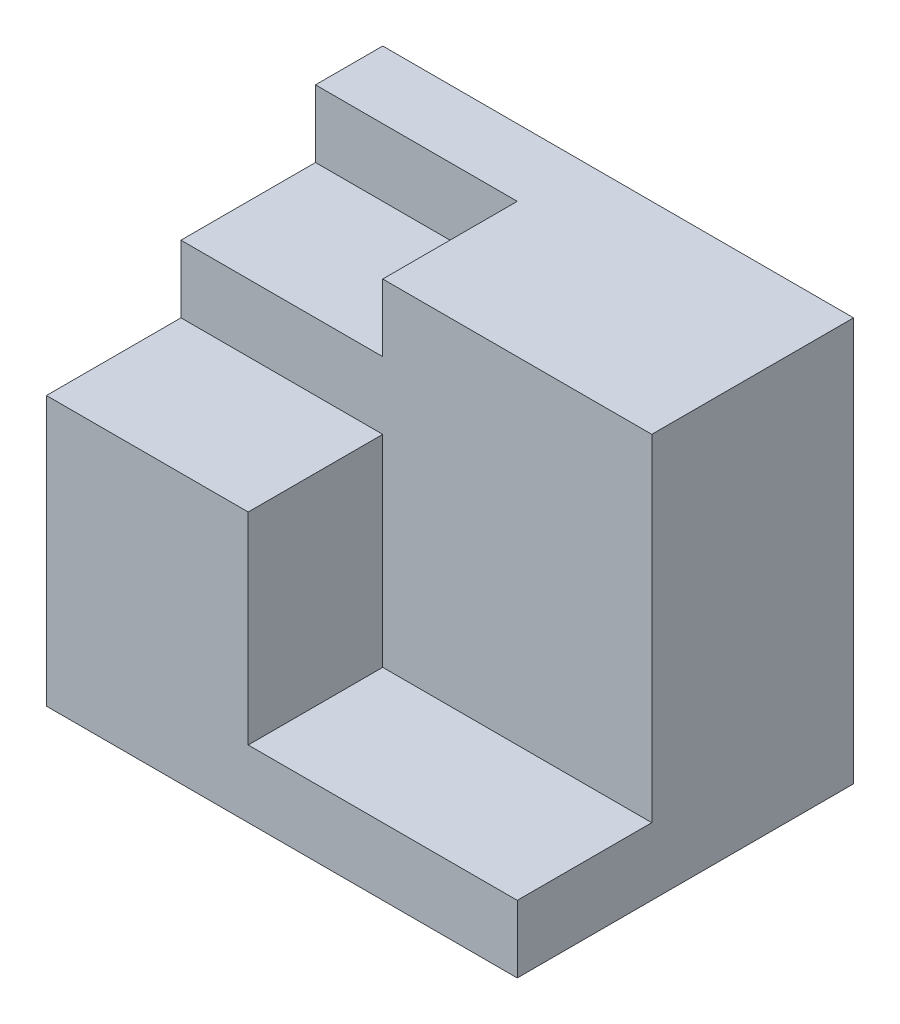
ISO-10303-21;
HEADER;
FILE_DESCRIPTION(('STEP AP214'),'2;1');
FILE_NAME('part.step','',(''),(''),'','','');
FILE_SCHEMA(('AUTOMOTIVE_DESIGN { 1 0 10303 214 1 1 1 1 }'));
ENDSEC;
DATA;
#1=APPLICATION_CONTEXT('core data for automotive mechanical design processes');
#2=APPLICATION_PROTOCOL_DEFINITION('international standard','automotive_design',2000,#1);
#3=PRODUCT_CONTEXT('',#1,'mechanical');
#4=PRODUCT('Part','Part','',(#3));
#5=PRODUCT_RELATED_PRODUCT_CATEGORY('part','',(#4));
#6=PRODUCT_DEFINITION_FORMATION('','',#4);
#7=PRODUCT_DEFINITION_CONTEXT('part definition',#1,'design');
#8=PRODUCT_DEFINITION('design','',#6,#7);
#9=PRODUCT_DEFINITION_SHAPE('','',#8);
#10=(LENGTH_UNIT() NAMED_UNIT(*) SI_UNIT(.MILLI.,.METRE.));
#11=(NAMED_UNIT(*) PLANE_ANGLE_UNIT() SI_UNIT($,.RADIAN.));
#12=(NAMED_UNIT(*) SI_UNIT($,.STERADIAN.) SOLID_ANGLE_UNIT());
#13=UNCERTAINTY_MEASURE_WITH_UNIT(LENGTH_MEASURE(1.E-05),#10,'distance_accuracy_value','');
#14=(GEOMETRIC_REPRESENTATION_CONTEXT(3) GLOBAL_UNCERTAINTY_ASSIGNED_CONTEXT((#13)) GLOBAL_UNIT_ASSIGNED_CONTEXT((#10,
#11,#12)) REPRESENTATION_CONTEXT('',''));
#15=CARTESIAN_POINT('',(0.,0.,0.));
#16=DIRECTION('',(0.,0.,1.));
#17=DIRECTION('',(1.,0.,0.));
#18=AXIS2_PLACEMENT_3D('',#15,#16,#17);
#19=CARTESIAN_POINT('',(-35.,30.,25.));
#20=DIRECTION('',(0.,-1.,0.));
#21=DIRECTION('',(0.,0.,-1.));
#22=AXIS2_PLACEMENT_3D('',#19,#20,#21);
#23=PLANE('',#22);
#24=DIRECTION('',(-1.,0.,0.));
#25=VECTOR('',#24,1.);
#26=CARTESIAN_POINT('',(-35.,30.,-15.));
#27=LINE('',#26,#25);
#28=CARTESIAN_POINT('',(-5.,30.,-15.));
#29=VERTEX_POINT('',#28);
#30=CARTESIAN_POINT('',(-35.,30.,-15.));
#31=VERTEX_POINT('',#30);
#32=EDGE_CURVE('E130',#29,#31,#27,.T.);
#33=ORIENTED_EDGE('',*,*,#32,.F.);
#34=DIRECTION('',(0.,0.,1.));
#35=VECTOR('',#34,1.);
#36=CARTESIAN_POINT('',(-5.,30.,-15.));
#37=LINE('',#36,#35);
#38=CARTESIAN_POINT('',(-5.,30.,5.));
#39=VERTEX_POINT('',#38);
#40=EDGE_CURVE('E138',#29,#39,#37,.T.);
#41=ORIENTED_EDGE('',*,*,#40,.T.);
#42=DIRECTION('',(-1.,0.,0.));
#43=VECTOR('',#42,1.);
#44=CARTESIAN_POINT('',(35.,30.,5.));
#45=LINE('',#44,#43);
#46=CARTESIAN_POINT('',(35.,30.,5.));
#47=VERTEX_POINT('',#46);
#48=EDGE_CURVE('E156',#47,#39,#45,.T.);
#49=ORIENTED_EDGE('',*,*,#48,.F.);
#50=DIRECTION('',(0.,0.,-1.));
#51=VECTOR('',#50,1.);
#52=CARTESIAN_POINT('',(35.,30.,25.));
#53=LINE('',#52,#51);
#54=CARTESIAN_POINT('',(35.,30.,-25.));
#55=VERTEX_POINT('',#54);
#56=EDGE_CURVE('E193',#47,#55,#53,.T.);
#57=ORIENTED_EDGE('',*,*,#56,.T.);
#58=DIRECTION('',(-1.,0.,0.));
#59=VECTOR('',#58,1.);
#60=CARTESIAN_POINT('',(-35.,30.,-25.));
#61=LINE('',#60,#59);
#62=CARTESIAN_POINT('',(-35.,30.,-25.));
#63=VERTEX_POINT('',#62);
#64=EDGE_CURVE('E177',#55,#63,#61,.T.);
#65=ORIENTED_EDGE('',*,*,#64,.T.);
#66=DIRECTION('',(0.,0.,-1.));
#67=VECTOR('',#66,1.);
#68=CARTESIAN_POINT('',(-35.,30.,25.));
#69=LINE('',#68,#67);
#70=EDGE_CURVE('E182',#31,#63,#69,.T.);
#71=ORIENTED_EDGE('',*,*,#70,.F.);
#72=EDGE_LOOP('',(#33,#41,#49,#57,#65,#71));
#73=FACE_BOUND('',#72,.T.);
#74=ADVANCED_FACE('F33',(#73),#23,.F.);
#75=CARTESIAN_POINT('',(-35.,30.,25.));
#76=DIRECTION('',(1.,0.,0.));
#77=DIRECTION('',(0.,1.,0.));
#78=AXIS2_PLACEMENT_3D('',#75,#76,#77);
#79=PLANE('',#78);
#80=DIRECTION('',(0.,-1.,0.));
#81=VECTOR('',#80,1.);
#82=CARTESIAN_POINT('',(-35.,30.,5.));
#83=LINE('',#82,#81);
#84=CARTESIAN_POINT('',(-35.,20.,5.));
#85=VERTEX_POINT('',#84);
#86=CARTESIAN_POINT('',(-35.,9.99999999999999,5.));
#87=VERTEX_POINT('',#86);
#88=EDGE_CURVE('E136',#85,#87,#83,.T.);
#89=ORIENTED_EDGE('',*,*,#88,.F.);
#90=DIRECTION('',(0.,0.,1.));
#91=VECTOR('',#90,1.);
#92=CARTESIAN_POINT('',(-35.,20.,-15.));
#93=LINE('',#92,#91);
#94=CARTESIAN_POINT('',(-35.,20.,-15.));
#95=VERTEX_POINT('',#94);
#96=EDGE_CURVE('E48',#95,#85,#93,.T.);
#97=ORIENTED_EDGE('',*,*,#96,.F.);
#98=DIRECTION('',(0.,-1.,0.));
#99=VECTOR('',#98,1.);
#100=CARTESIAN_POINT('',(-35.,30.,-15.));
#101=LINE('',#100,#99);
#102=EDGE_CURVE('E125',#31,#95,#101,.T.);
#103=ORIENTED_EDGE('',*,*,#102,.F.);
#104=ORIENTED_EDGE('',*,*,#70,.T.);
#105=DIRECTION('',(0.,-1.,0.));
#106=VECTOR('',#105,1.);
#107=CARTESIAN_POINT('',(-35.,30.,-25.));
#108=LINE('',#107,#106);
#109=CARTESIAN_POINT('',(-35.,-30.,-25.));
#110=VERTEX_POINT('',#109);
#111=EDGE_CURVE('E168',#63,#110,#108,.T.);
#112=ORIENTED_EDGE('',*,*,#111,.T.);
#113=DIRECTION('',(0.,0.,-1.));
#114=VECTOR('',#113,1.);
#115=CARTESIAN_POINT('',(-35.,-30.,25.));
#116=LINE('',#115,#114);
#117=CARTESIAN_POINT('',(-35.,-30.,25.));
#118=VERTEX_POINT('',#117);
#119=EDGE_CURVE('E11',#118,#110,#116,.T.);
#120=ORIENTED_EDGE('',*,*,#119,.F.);
#121=DIRECTION('',(0.,-1.,0.));
#122=VECTOR('',#121,1.);
#123=CARTESIAN_POINT('',(-35.,30.,25.));
#124=LINE('',#123,#122);
#125=CARTESIAN_POINT('',(-35.,9.99999999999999,25.));
#126=VERTEX_POINT('',#125);
#127=EDGE_CURVE('E174',#126,#118,#124,.T.);
#128=ORIENTED_EDGE('',*,*,#127,.F.);
#129=DIRECTION('',(0.,0.,1.));
#130=VECTOR('',#129,1.);
#131=CARTESIAN_POINT('',(-35.,9.99999999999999,5.));
#132=LINE('',#131,#130);
#133=EDGE_CURVE('E56',#87,#126,#132,.T.);
#134=ORIENTED_EDGE('',*,*,#133,.F.);
#135=EDGE_LOOP('',(#89,#97,#103,#104,#112,#120,#128,#134));
#136=FACE_BOUND('',#135,.T.);
#137=ADVANCED_FACE('F35',(#136),#79,.F.);
#138=CARTESIAN_POINT('',(-35.,-30.,25.));
#139=DIRECTION('',(0.,1.,0.));
#140=DIRECTION('',(0.,0.,1.));
#141=AXIS2_PLACEMENT_3D('',#138,#139,#140);
#142=PLANE('',#141);
#143=DIRECTION('',(1.,0.,0.));
#144=VECTOR('',#143,1.);
#145=CARTESIAN_POINT('',(-35.,-30.,-25.));
#146=LINE('',#145,#144);
#147=CARTESIAN_POINT('',(35.,-30.,-25.));
#148=VERTEX_POINT('',#147);
#149=EDGE_CURVE('E185',#110,#148,#146,.T.);
#150=ORIENTED_EDGE('',*,*,#149,.T.);
#151=DIRECTION('',(0.,0.,-1.));
#152=VECTOR('',#151,1.);
#153=CARTESIAN_POINT('',(35.,-30.,25.));
#154=LINE('',#153,#152);
#155=CARTESIAN_POINT('',(35.,-30.,25.));
#156=VERTEX_POINT('',#155);
#157=EDGE_CURVE('E41',#156,#148,#154,.T.);
#158=ORIENTED_EDGE('',*,*,#157,.F.);
#159=DIRECTION('',(1.,0.,0.));
#160=VECTOR('',#159,1.);
#161=CARTESIAN_POINT('',(-35.,-30.,25.));
#162=LINE('',#161,#160);
#163=EDGE_CURVE('E176',#118,#156,#162,.T.);
#164=ORIENTED_EDGE('',*,*,#163,.F.);
#165=ORIENTED_EDGE('',*,*,#119,.T.);
#166=EDGE_LOOP('',(#150,#158,#164,#165));
#167=FACE_BOUND('',#166,.T.);
#168=ADVANCED_FACE('F224',(#167),#142,.F.);
#169=CARTESIAN_POINT('',(35.,30.,25.));
#170=DIRECTION('',(-1.,0.,0.));
#171=DIRECTION('',(0.,-1.,0.));
#172=AXIS2_PLACEMENT_3D('',#169,#170,#171);
#173=PLANE('',#172);
#174=DIRECTION('',(0.,1.,0.));
#175=VECTOR('',#174,1.);
#176=CARTESIAN_POINT('',(35.,-20.,5.));
#177=LINE('',#176,#175);
#178=CARTESIAN_POINT('',(35.,-20.,5.));
#179=VERTEX_POINT('',#178);
#180=EDGE_CURVE('E154',#179,#47,#177,.T.);
#181=ORIENTED_EDGE('',*,*,#180,.F.);
#182=DIRECTION('',(0.,0.,1.));
#183=VECTOR('',#182,1.);
#184=CARTESIAN_POINT('',(35.,-20.,5.));
#185=LINE('',#184,#183);
#186=CARTESIAN_POINT('',(35.,-20.,25.));
#187=VERTEX_POINT('',#186);
#188=EDGE_CURVE('E165',#179,#187,#185,.T.);
#189=ORIENTED_EDGE('',*,*,#188,.T.);
#190=DIRECTION('',(0.,1.,0.));
#191=VECTOR('',#190,1.);
#192=CARTESIAN_POINT('',(35.,30.,25.));
#193=LINE('',#192,#191);
#194=EDGE_CURVE('E179',#156,#187,#193,.T.);
#195=ORIENTED_EDGE('',*,*,#194,.F.);
#196=ORIENTED_EDGE('',*,*,#157,.T.);
#197=DIRECTION('',(0.,1.,0.));
#198=VECTOR('',#197,1.);
#199=CARTESIAN_POINT('',(35.,30.,-25.));
#200=LINE('',#199,#198);
#201=EDGE_CURVE('E187',#148,#55,#200,.T.);
#202=ORIENTED_EDGE('',*,*,#201,.T.);
#203=ORIENTED_EDGE('',*,*,#56,.F.);
#204=EDGE_LOOP('',(#181,#189,#195,#196,#202,#203));
#205=FACE_BOUND('',#204,.T.);
#206=ADVANCED_FACE('F200',(#205),#173,.F.);
#207=CARTESIAN_POINT('',(0.,0.,25.));
#208=DIRECTION('',(0.,0.,1.));
#209=DIRECTION('',(1.,0.,0.));
#210=AXIS2_PLACEMENT_3D('',#207,#208,#209);
#211=PLANE('',#210);
#212=DIRECTION('',(1.,0.,0.));
#213=VECTOR('',#212,1.);
#214=CARTESIAN_POINT('',(-5.,-20.,25.));
#215=LINE('',#214,#213);
#216=CARTESIAN_POINT('',(-5.,-20.,25.));
#217=VERTEX_POINT('',#216);
#218=EDGE_CURVE('E145',#217,#187,#215,.T.);
#219=ORIENTED_EDGE('',*,*,#218,.F.);
#220=DIRECTION('',(0.,-1.,0.));
#221=VECTOR('',#220,1.);
#222=CARTESIAN_POINT('',(-5.,9.99999999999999,25.));
#223=LINE('',#222,#221);
#224=CARTESIAN_POINT('',(-5.,9.99999999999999,25.));
#225=VERTEX_POINT('',#224);
#226=EDGE_CURVE('E161',#225,#217,#223,.T.);
#227=ORIENTED_EDGE('',*,*,#226,.F.);
#228=DIRECTION('',(1.,0.,0.));
#229=VECTOR('',#228,1.);
#230=CARTESIAN_POINT('',(-35.,9.99999999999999,25.));
#231=LINE('',#230,#229);
#232=EDGE_CURVE('E159',#126,#225,#231,.T.);
#233=ORIENTED_EDGE('',*,*,#232,.F.);
#234=ORIENTED_EDGE('',*,*,#127,.T.);
#235=ORIENTED_EDGE('',*,*,#163,.T.);
#236=ORIENTED_EDGE('',*,*,#194,.T.);
#237=EDGE_LOOP('',(#219,#227,#233,#234,#235,#236));
#238=FACE_BOUND('',#237,.T.);
#239=ADVANCED_FACE('F221',(#238),#211,.T.);
#240=CARTESIAN_POINT('',(0.,0.,-25.));
#241=DIRECTION('',(0.,0.,1.));
#242=DIRECTION('',(1.,0.,0.));
#243=AXIS2_PLACEMENT_3D('',#240,#241,#242);
#244=PLANE('',#243);
#245=ORIENTED_EDGE('',*,*,#111,.F.);
#246=ORIENTED_EDGE('',*,*,#64,.F.);
#247=ORIENTED_EDGE('',*,*,#201,.F.);
#248=ORIENTED_EDGE('',*,*,#149,.F.);
#249=EDGE_LOOP('',(#245,#246,#247,#248));
#250=FACE_BOUND('',#249,.T.);
#251=ADVANCED_FACE('F207',(#250),#244,.F.);
#252=CARTESIAN_POINT('',(-5.,-20.,5.));
#253=DIRECTION('',(0.,-1.,0.));
#254=DIRECTION('',(0.,0.,-1.));
#255=AXIS2_PLACEMENT_3D('',#252,#253,#254);
#256=PLANE('',#255);
#257=ORIENTED_EDGE('',*,*,#218,.T.);
#258=ORIENTED_EDGE('',*,*,#188,.F.);
#259=DIRECTION('',(1.,0.,0.));
#260=VECTOR('',#259,1.);
#261=CARTESIAN_POINT('',(-5.,-20.,5.));
#262=LINE('',#261,#260);
#263=CARTESIAN_POINT('',(-5.,-20.,5.));
#264=VERTEX_POINT('',#263);
#265=EDGE_CURVE('E151',#264,#179,#262,.T.);
#266=ORIENTED_EDGE('',*,*,#265,.F.);
#267=DIRECTION('',(0.,0.,1.));
#268=VECTOR('',#267,1.);
#269=CARTESIAN_POINT('',(-5.,-20.,5.));
#270=LINE('',#269,#268);
#271=EDGE_CURVE('E169',#264,#217,#270,.T.);
#272=ORIENTED_EDGE('',*,*,#271,.T.);
#273=EDGE_LOOP('',(#257,#258,#266,#272));
#274=FACE_BOUND('',#273,.T.);
#275=ADVANCED_FACE('F217',(#274),#256,.F.);
#276=CARTESIAN_POINT('',(-5.,9.99999999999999,5.));
#277=DIRECTION('',(-1.,0.,0.));
#278=DIRECTION('',(0.,-1.,0.));
#279=AXIS2_PLACEMENT_3D('',#276,#277,#278);
#280=PLANE('',#279);
#281=ORIENTED_EDGE('',*,*,#226,.T.);
#282=ORIENTED_EDGE('',*,*,#271,.F.);
#283=DIRECTION('',(0.,-1.,0.));
#284=VECTOR('',#283,1.);
#285=CARTESIAN_POINT('',(-5.,9.99999999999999,5.));
#286=LINE('',#285,#284);
#287=CARTESIAN_POINT('',(-5.,9.99999999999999,5.));
#288=VERTEX_POINT('',#287);
#289=EDGE_CURVE('E148',#288,#264,#286,.T.);
#290=ORIENTED_EDGE('',*,*,#289,.F.);
#291=DIRECTION('',(0.,0.,1.));
#292=VECTOR('',#291,1.);
#293=CARTESIAN_POINT('',(-5.,9.99999999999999,5.));
#294=LINE('',#293,#292);
#295=EDGE_CURVE('E171',#288,#225,#294,.T.);
#296=ORIENTED_EDGE('',*,*,#295,.T.);
#297=EDGE_LOOP('',(#281,#282,#290,#296));
#298=FACE_BOUND('',#297,.T.);
#299=ADVANCED_FACE('F243',(#298),#280,.F.);
#300=CARTESIAN_POINT('',(-35.,9.99999999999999,5.));
#301=DIRECTION('',(0.,-1.,0.));
#302=DIRECTION('',(0.,0.,-1.));
#303=AXIS2_PLACEMENT_3D('',#300,#301,#302);
#304=PLANE('',#303);
#305=ORIENTED_EDGE('',*,*,#232,.T.);
#306=ORIENTED_EDGE('',*,*,#295,.F.);
#307=DIRECTION('',(1.,0.,0.));
#308=VECTOR('',#307,1.);
#309=CARTESIAN_POINT('',(-35.,9.99999999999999,5.));
#310=LINE('',#309,#308);
#311=EDGE_CURVE('E144',#87,#288,#310,.T.);
#312=ORIENTED_EDGE('',*,*,#311,.F.);
#313=ORIENTED_EDGE('',*,*,#133,.T.);
#314=EDGE_LOOP('',(#305,#306,#312,#313));
#315=FACE_BOUND('',#314,.T.);
#316=ADVANCED_FACE('F240',(#315),#304,.F.);
#317=CARTESIAN_POINT('',(0.,0.,5.));
#318=DIRECTION('',(0.,0.,1.));
#319=DIRECTION('',(1.,0.,0.));
#320=AXIS2_PLACEMENT_3D('',#317,#318,#319);
#321=PLANE('',#320);
#322=DIRECTION('',(0.,1.,0.));
#323=VECTOR('',#322,1.);
#324=CARTESIAN_POINT('',(-5.,30.,5.));
#325=LINE('',#324,#323);
#326=CARTESIAN_POINT('',(-5.,20.,5.));
#327=VERTEX_POINT('',#326);
#328=EDGE_CURVE('E133',#327,#39,#325,.T.);
#329=ORIENTED_EDGE('',*,*,#328,.F.);
#330=DIRECTION('',(1.,0.,0.));
#331=VECTOR('',#330,1.);
#332=CARTESIAN_POINT('',(-35.,20.,5.));
#333=LINE('',#332,#331);
#334=EDGE_CURVE('E332',#85,#327,#333,.T.);
#335=ORIENTED_EDGE('',*,*,#334,.F.);
#336=ORIENTED_EDGE('',*,*,#88,.T.);
#337=ORIENTED_EDGE('',*,*,#311,.T.);
#338=ORIENTED_EDGE('',*,*,#289,.T.);
#339=ORIENTED_EDGE('',*,*,#265,.T.);
#340=ORIENTED_EDGE('',*,*,#180,.T.);
#341=ORIENTED_EDGE('',*,*,#48,.T.);
#342=EDGE_LOOP('',(#329,#335,#336,#337,#338,#339,#340,#341));
#343=FACE_BOUND('',#342,.T.);
#344=ADVANCED_FACE('F213',(#343),#321,.T.);
#345=CARTESIAN_POINT('',(-5.,30.,-15.));
#346=DIRECTION('',(1.,0.,0.));
#347=DIRECTION('',(0.,1.,0.));
#348=AXIS2_PLACEMENT_3D('',#345,#346,#347);
#349=PLANE('',#348);
#350=ORIENTED_EDGE('',*,*,#328,.T.);
#351=ORIENTED_EDGE('',*,*,#40,.F.);
#352=DIRECTION('',(0.,1.,0.));
#353=VECTOR('',#352,1.);
#354=CARTESIAN_POINT('',(-5.,30.,-15.));
#355=LINE('',#354,#353);
#356=CARTESIAN_POINT('',(-5.,20.,-15.));
#357=VERTEX_POINT('',#356);
#358=EDGE_CURVE('E124',#357,#29,#355,.T.);
#359=ORIENTED_EDGE('',*,*,#358,.F.);
#360=DIRECTION('',(0.,0.,1.));
#361=VECTOR('',#360,1.);
#362=CARTESIAN_POINT('',(-5.,20.,-15.));
#363=LINE('',#362,#361);
#364=EDGE_CURVE('E120',#357,#327,#363,.T.);
#365=ORIENTED_EDGE('',*,*,#364,.T.);
#366=EDGE_LOOP('',(#350,#351,#359,#365));
#367=FACE_BOUND('',#366,.T.);
#368=ADVANCED_FACE('F251',(#367),#349,.F.);
#369=CARTESIAN_POINT('',(-35.,20.,-15.));
#370=DIRECTION('',(0.,-1.,0.));
#371=DIRECTION('',(0.,0.,-1.));
#372=AXIS2_PLACEMENT_3D('',#369,#370,#371);
#373=PLANE('',#372);
#374=ORIENTED_EDGE('',*,*,#334,.T.);
#375=ORIENTED_EDGE('',*,*,#364,.F.);
#376=DIRECTION('',(1.,0.,0.));
#377=VECTOR('',#376,1.);
#378=CARTESIAN_POINT('',(-35.,20.,-15.));
#379=LINE('',#378,#377);
#380=EDGE_CURVE('E117',#95,#357,#379,.T.);
#381=ORIENTED_EDGE('',*,*,#380,.F.);
#382=ORIENTED_EDGE('',*,*,#96,.T.);
#383=EDGE_LOOP('',(#374,#375,#381,#382));
#384=FACE_BOUND('',#383,.T.);
#385=ADVANCED_FACE('F119',(#384),#373,.F.);
#386=CARTESIAN_POINT('',(0.,0.,-15.));
#387=DIRECTION('',(0.,0.,1.));
#388=DIRECTION('',(1.,0.,0.));
#389=AXIS2_PLACEMENT_3D('',#386,#387,#388);
#390=PLANE('',#389);
#391=ORIENTED_EDGE('',*,*,#102,.T.);
#392=ORIENTED_EDGE('',*,*,#380,.T.);
#393=ORIENTED_EDGE('',*,*,#358,.T.);
#394=ORIENTED_EDGE('',*,*,#32,.T.);
#395=EDGE_LOOP('',(#391,#392,#393,#394));
#396=FACE_BOUND('',#395,.T.);
#397=ADVANCED_FACE('F128',(#396),#390,.T.);
#398=CLOSED_SHELL('',(#74,#137,#168,#206,#239,#251,#275,#299,#316,#344,#368,#385,#397));
#399=MANIFOLD_SOLID_BREP('B2',#398);
#400=ADVANCED_BREP_SHAPE_REPRESENTATION('',(#18,#399),#14);
#401=SHAPE_DEFINITION_REPRESENTATION(#9,#400);
ENDSEC;
END-ISO-10303-21;
